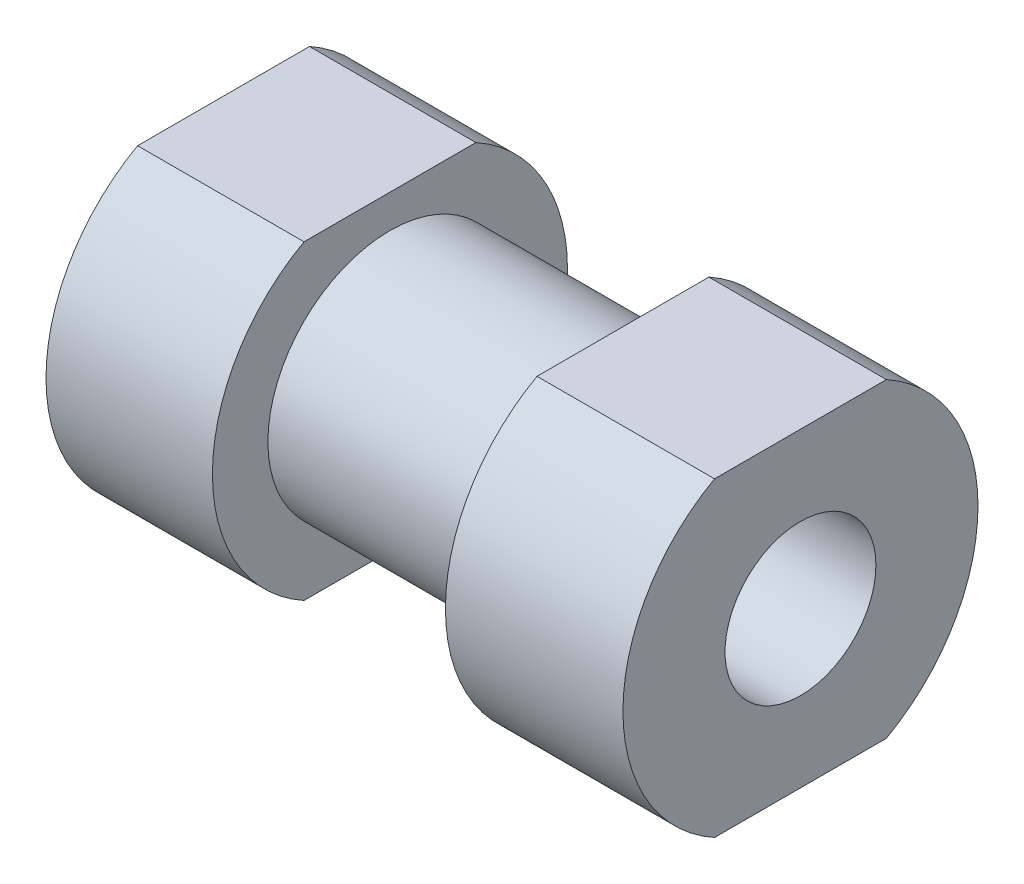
ISO-10303-21;
HEADER;
FILE_DESCRIPTION(('STEP AP214'),'2;1');
FILE_NAME('part.step','',(''),(''),'','','');
FILE_SCHEMA(('AUTOMOTIVE_DESIGN { 1 0 10303 214 1 1 1 1 }'));
ENDSEC;
DATA;
#1=APPLICATION_CONTEXT('core data for automotive mechanical design processes');
#2=APPLICATION_PROTOCOL_DEFINITION('international standard','automotive_design',2000,#1);
#3=PRODUCT_CONTEXT('',#1,'mechanical');
#4=PRODUCT('Part','Part','',(#3));
#5=PRODUCT_RELATED_PRODUCT_CATEGORY('part','',(#4));
#6=PRODUCT_DEFINITION_FORMATION('','',#4);
#7=PRODUCT_DEFINITION_CONTEXT('part definition',#1,'design');
#8=PRODUCT_DEFINITION('design','',#6,#7);
#9=PRODUCT_DEFINITION_SHAPE('','',#8);
#10=(LENGTH_UNIT() NAMED_UNIT(*) SI_UNIT(.MILLI.,.METRE.));
#11=(NAMED_UNIT(*) PLANE_ANGLE_UNIT() SI_UNIT($,.RADIAN.));
#12=(NAMED_UNIT(*) SI_UNIT($,.STERADIAN.) SOLID_ANGLE_UNIT());
#13=UNCERTAINTY_MEASURE_WITH_UNIT(LENGTH_MEASURE(1.E-05),#10,'distance_accuracy_value','');
#14=(GEOMETRIC_REPRESENTATION_CONTEXT(3) GLOBAL_UNCERTAINTY_ASSIGNED_CONTEXT((#13)) GLOBAL_UNIT_ASSIGNED_CONTEXT((#10,
#11,#12)) REPRESENTATION_CONTEXT('',''));
#15=CARTESIAN_POINT('',(0.,0.,0.));
#16=DIRECTION('',(0.,0.,1.));
#17=DIRECTION('',(1.,0.,0.));
#18=AXIS2_PLACEMENT_3D('',#15,#16,#17);
#19=CARTESIAN_POINT('',(97.4858594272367,330.502190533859,0.));
#20=DIRECTION('',(1.,0.,0.));
#21=DIRECTION('',(0.,0.,-1.));
#22=AXIS2_PLACEMENT_3D('',#19,#20,#21);
#23=CYLINDRICAL_SURFACE('',#22,8.);
#24=DIRECTION('',(1.,0.,0.));
#25=VECTOR('',#24,1.);
#26=CARTESIAN_POINT('',(97.4858594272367,337.502190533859,-3.87298334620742));
#27=LINE('',#26,#25);
#28=CARTESIAN_POINT('',(78.9858594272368,337.502190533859,-3.87298334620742));
#29=VERTEX_POINT('',#28);
#30=CARTESIAN_POINT('',(71.4858594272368,337.502190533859,-3.87298334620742));
#31=VERTEX_POINT('',#30);
#32=EDGE_CURVE('E192',#29,#31,#27,.F.);
#33=ORIENTED_EDGE('',*,*,#32,.F.);
#34=CARTESIAN_POINT('',(78.9858594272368,330.502190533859,0.));
#35=DIRECTION('',(1.,0.,0.));
#36=DIRECTION('',(0.,0.,-1.));
#37=AXIS2_PLACEMENT_3D('',#34,#35,#36);
#38=CIRCLE('',#37,8.);
#39=CARTESIAN_POINT('',(78.9858594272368,323.502190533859,-3.87298334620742));
#40=VERTEX_POINT('',#39);
#41=EDGE_CURVE('E117',#40,#29,#38,.T.);
#42=ORIENTED_EDGE('',*,*,#41,.F.);
#43=DIRECTION('',(1.,0.,0.));
#44=VECTOR('',#43,1.);
#45=CARTESIAN_POINT('',(97.4858594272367,323.502190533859,-3.87298334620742));
#46=LINE('',#45,#44);
#47=CARTESIAN_POINT('',(71.4858594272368,323.502190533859,-3.87298334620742));
#48=VERTEX_POINT('',#47);
#49=EDGE_CURVE('E137',#48,#40,#46,.T.);
#50=ORIENTED_EDGE('',*,*,#49,.F.);
#51=CARTESIAN_POINT('',(71.4858594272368,330.502190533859,0.));
#52=DIRECTION('',(1.,0.,0.));
#53=DIRECTION('',(0.,0.,-1.));
#54=AXIS2_PLACEMENT_3D('',#51,#52,#53);
#55=CIRCLE('',#54,8.);
#56=EDGE_CURVE('E121',#48,#31,#55,.T.);
#57=ORIENTED_EDGE('',*,*,#56,.T.);
#58=EDGE_LOOP('',(#33,#42,#50,#57));
#59=FACE_BOUND('',#58,.T.);
#60=ADVANCED_FACE('F16',(#59),#23,.T.);
#61=CARTESIAN_POINT('',(97.4858594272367,330.502190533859,0.));
#62=DIRECTION('',(1.,0.,0.));
#63=DIRECTION('',(0.,0.,-1.));
#64=AXIS2_PLACEMENT_3D('',#61,#62,#63);
#65=CYLINDRICAL_SURFACE('',#64,8.);
#66=DIRECTION('',(1.,0.,0.));
#67=VECTOR('',#66,1.);
#68=CARTESIAN_POINT('',(97.4858594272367,337.502190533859,-3.87298334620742));
#69=LINE('',#68,#67);
#70=CARTESIAN_POINT('',(97.4858594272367,337.502190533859,-3.87298334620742));
#71=VERTEX_POINT('',#70);
#72=CARTESIAN_POINT('',(89.4858594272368,337.502190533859,-3.87298334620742));
#73=VERTEX_POINT('',#72);
#74=EDGE_CURVE('E82',#71,#73,#69,.F.);
#75=ORIENTED_EDGE('',*,*,#74,.F.);
#76=CARTESIAN_POINT('',(97.4858594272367,330.502190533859,0.));
#77=DIRECTION('',(1.,0.,0.));
#78=DIRECTION('',(0.,0.,-1.));
#79=AXIS2_PLACEMENT_3D('',#76,#77,#78);
#80=CIRCLE('',#79,8.);
#81=CARTESIAN_POINT('',(97.4858594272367,323.502190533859,-3.87298334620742));
#82=VERTEX_POINT('',#81);
#83=EDGE_CURVE('E92',#82,#71,#80,.T.);
#84=ORIENTED_EDGE('',*,*,#83,.F.);
#85=DIRECTION('',(1.,0.,0.));
#86=VECTOR('',#85,1.);
#87=CARTESIAN_POINT('',(97.4858594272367,323.502190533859,-3.87298334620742));
#88=LINE('',#87,#86);
#89=CARTESIAN_POINT('',(89.4858594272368,323.502190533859,-3.87298334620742));
#90=VERTEX_POINT('',#89);
#91=EDGE_CURVE('E129',#90,#82,#88,.T.);
#92=ORIENTED_EDGE('',*,*,#91,.F.);
#93=CARTESIAN_POINT('',(89.4858594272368,330.502190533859,0.));
#94=DIRECTION('',(1.,0.,0.));
#95=DIRECTION('',(0.,0.,-1.));
#96=AXIS2_PLACEMENT_3D('',#93,#94,#95);
#97=CIRCLE('',#96,8.);
#98=EDGE_CURVE('E94',#90,#73,#97,.T.);
#99=ORIENTED_EDGE('',*,*,#98,.T.);
#100=EDGE_LOOP('',(#75,#84,#92,#99));
#101=FACE_BOUND('',#100,.T.);
#102=ADVANCED_FACE('F90',(#101),#65,.T.);
#103=CARTESIAN_POINT('',(71.4858594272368,330.502190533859,0.));
#104=DIRECTION('',(-1.,0.,0.));
#105=DIRECTION('',(0.,0.,1.));
#106=AXIS2_PLACEMENT_3D('',#103,#104,#105);
#107=PLANE('',#106);
#108=DIRECTION('',(0.,0.,-1.));
#109=VECTOR('',#108,1.);
#110=CARTESIAN_POINT('',(71.4858594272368,337.502190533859,-7.34638575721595));
#111=LINE('',#110,#109);
#112=CARTESIAN_POINT('',(71.4858594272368,337.502190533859,3.87298334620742));
#113=VERTEX_POINT('',#112);
#114=EDGE_CURVE('E197',#113,#31,#111,.T.);
#115=ORIENTED_EDGE('',*,*,#114,.T.);
#116=ORIENTED_EDGE('',*,*,#56,.F.);
#117=DIRECTION('',(0.,0.,1.));
#118=VECTOR('',#117,1.);
#119=CARTESIAN_POINT('',(71.4858594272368,323.502190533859,-7.34638575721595));
#120=LINE('',#119,#118);
#121=CARTESIAN_POINT('',(71.4858594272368,323.502190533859,3.87298334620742));
#122=VERTEX_POINT('',#121);
#123=EDGE_CURVE('E198',#48,#122,#120,.T.);
#124=ORIENTED_EDGE('',*,*,#123,.T.);
#125=EDGE_CURVE('E120',#113,#122,#55,.T.);
#126=ORIENTED_EDGE('',*,*,#125,.F.);
#127=EDGE_LOOP('',(#115,#116,#124,#126));
#128=FACE_BOUND('',#127,.T.);
#129=ADVANCED_FACE('F18',(#128),#107,.T.);
#130=DIRECTION('',(1.,0.,0.));
#131=VECTOR('',#130,1.);
#132=CARTESIAN_POINT('',(97.4858594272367,337.502190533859,3.87298334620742));
#133=LINE('',#132,#131);
#134=CARTESIAN_POINT('',(78.9858594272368,337.502190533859,3.87298334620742));
#135=VERTEX_POINT('',#134);
#136=EDGE_CURVE('E31',#113,#135,#133,.T.);
#137=ORIENTED_EDGE('',*,*,#136,.F.);
#138=ORIENTED_EDGE('',*,*,#125,.T.);
#139=DIRECTION('',(1.,0.,0.));
#140=VECTOR('',#139,1.);
#141=CARTESIAN_POINT('',(97.4858594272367,323.502190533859,3.87298334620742));
#142=LINE('',#141,#140);
#143=CARTESIAN_POINT('',(78.9858594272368,323.502190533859,3.87298334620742));
#144=VERTEX_POINT('',#143);
#145=EDGE_CURVE('E143',#144,#122,#142,.F.);
#146=ORIENTED_EDGE('',*,*,#145,.F.);
#147=EDGE_CURVE('E116',#135,#144,#38,.T.);
#148=ORIENTED_EDGE('',*,*,#147,.F.);
#149=EDGE_LOOP('',(#137,#138,#146,#148));
#150=FACE_BOUND('',#149,.T.);
#151=ADVANCED_FACE('F169',(#150),#23,.T.);
#152=CARTESIAN_POINT('',(78.9858594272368,338.502190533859,0.));
#153=DIRECTION('',(1.,0.,0.));
#154=DIRECTION('',(0.,0.,-1.));
#155=AXIS2_PLACEMENT_3D('',#152,#153,#154);
#156=PLANE('',#155);
#157=DIRECTION('',(0.,0.,-1.));
#158=VECTOR('',#157,1.);
#159=CARTESIAN_POINT('',(78.9858594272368,337.502190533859,0.));
#160=LINE('',#159,#158);
#161=EDGE_CURVE('E95',#135,#29,#160,.T.);
#162=ORIENTED_EDGE('',*,*,#161,.F.);
#163=ORIENTED_EDGE('',*,*,#147,.T.);
#164=DIRECTION('',(0.,0.,1.));
#165=VECTOR('',#164,1.);
#166=CARTESIAN_POINT('',(78.9858594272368,323.502190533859,0.));
#167=LINE('',#166,#165);
#168=EDGE_CURVE('E133',#40,#144,#167,.T.);
#169=ORIENTED_EDGE('',*,*,#168,.F.);
#170=ORIENTED_EDGE('',*,*,#41,.T.);
#171=EDGE_LOOP('',(#162,#163,#169,#170));
#172=FACE_BOUND('',#171,.T.);
#173=CARTESIAN_POINT('',(78.9858594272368,330.502190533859,0.));
#174=DIRECTION('',(1.,0.,0.));
#175=DIRECTION('',(0.,0.,-1.));
#176=AXIS2_PLACEMENT_3D('',#173,#174,#175);
#177=CIRCLE('',#176,5.5);
#178=CARTESIAN_POINT('',(78.9858594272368,330.502190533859,-5.5));
#179=VERTEX_POINT('',#178);
#180=EDGE_CURVE('E113',#179,#179,#177,.T.);
#181=ORIENTED_EDGE('',*,*,#180,.F.);
#182=EDGE_LOOP('',(#181));
#183=FACE_BOUND('',#182,.T.);
#184=ADVANCED_FACE('F179',(#172,#183),#156,.T.);
#185=CARTESIAN_POINT('',(97.4858594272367,330.502190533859,0.));
#186=DIRECTION('',(1.,0.,0.));
#187=DIRECTION('',(0.,0.,-1.));
#188=AXIS2_PLACEMENT_3D('',#185,#186,#187);
#189=CYLINDRICAL_SURFACE('',#188,5.5);
#190=ORIENTED_EDGE('',*,*,#180,.T.);
#191=EDGE_LOOP('',(#190));
#192=FACE_BOUND('',#191,.T.);
#193=CARTESIAN_POINT('',(89.4858594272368,330.502190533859,0.));
#194=DIRECTION('',(1.,0.,0.));
#195=DIRECTION('',(0.,0.,-1.));
#196=AXIS2_PLACEMENT_3D('',#193,#194,#195);
#197=CIRCLE('',#196,5.5);
#198=CARTESIAN_POINT('',(89.4858594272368,330.502190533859,-5.5));
#199=VERTEX_POINT('',#198);
#200=EDGE_CURVE('E110',#199,#199,#197,.T.);
#201=ORIENTED_EDGE('',*,*,#200,.F.);
#202=EDGE_LOOP('',(#201));
#203=FACE_BOUND('',#202,.T.);
#204=ADVANCED_FACE('F186',(#192,#203),#189,.T.);
#205=CARTESIAN_POINT('',(89.4858594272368,336.002190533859,0.));
#206=DIRECTION('',(-1.,0.,0.));
#207=DIRECTION('',(0.,0.,1.));
#208=AXIS2_PLACEMENT_3D('',#205,#206,#207);
#209=PLANE('',#208);
#210=DIRECTION('',(0.,0.,1.));
#211=VECTOR('',#210,1.);
#212=CARTESIAN_POINT('',(89.4858594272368,337.502190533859,0.));
#213=LINE('',#212,#211);
#214=CARTESIAN_POINT('',(89.4858594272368,337.502190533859,3.87298334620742));
#215=VERTEX_POINT('',#214);
#216=EDGE_CURVE('E96',#73,#215,#213,.T.);
#217=ORIENTED_EDGE('',*,*,#216,.F.);
#218=ORIENTED_EDGE('',*,*,#98,.F.);
#219=DIRECTION('',(0.,0.,-1.));
#220=VECTOR('',#219,1.);
#221=CARTESIAN_POINT('',(89.4858594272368,323.502190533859,0.));
#222=LINE('',#221,#220);
#223=CARTESIAN_POINT('',(89.4858594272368,323.502190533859,3.87298334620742));
#224=VERTEX_POINT('',#223);
#225=EDGE_CURVE('E134',#224,#90,#222,.T.);
#226=ORIENTED_EDGE('',*,*,#225,.F.);
#227=EDGE_CURVE('E102',#215,#224,#97,.T.);
#228=ORIENTED_EDGE('',*,*,#227,.F.);
#229=EDGE_LOOP('',(#217,#218,#226,#228));
#230=FACE_BOUND('',#229,.T.);
#231=ORIENTED_EDGE('',*,*,#200,.T.);
#232=EDGE_LOOP('',(#231));
#233=FACE_BOUND('',#232,.T.);
#234=ADVANCED_FACE('F208',(#230,#233),#209,.T.);
#235=DIRECTION('',(1.,0.,0.));
#236=VECTOR('',#235,1.);
#237=CARTESIAN_POINT('',(97.4858594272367,337.502190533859,3.87298334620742));
#238=LINE('',#237,#236);
#239=CARTESIAN_POINT('',(97.4858594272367,337.502190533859,3.87298334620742));
#240=VERTEX_POINT('',#239);
#241=EDGE_CURVE('E38',#215,#240,#238,.T.);
#242=ORIENTED_EDGE('',*,*,#241,.F.);
#243=ORIENTED_EDGE('',*,*,#227,.T.);
#244=DIRECTION('',(1.,0.,0.));
#245=VECTOR('',#244,1.);
#246=CARTESIAN_POINT('',(97.4858594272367,323.502190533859,3.87298334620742));
#247=LINE('',#246,#245);
#248=CARTESIAN_POINT('',(97.4858594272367,323.502190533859,3.87298334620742));
#249=VERTEX_POINT('',#248);
#250=EDGE_CURVE('E127',#249,#224,#247,.F.);
#251=ORIENTED_EDGE('',*,*,#250,.F.);
#252=EDGE_CURVE('E103',#240,#249,#80,.T.);
#253=ORIENTED_EDGE('',*,*,#252,.F.);
#254=EDGE_LOOP('',(#242,#243,#251,#253));
#255=FACE_BOUND('',#254,.T.);
#256=ADVANCED_FACE('F131',(#255),#65,.T.);
#257=CARTESIAN_POINT('',(97.4858594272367,338.502190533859,0.));
#258=DIRECTION('',(1.,0.,0.));
#259=DIRECTION('',(0.,0.,-1.));
#260=AXIS2_PLACEMENT_3D('',#257,#258,#259);
#261=PLANE('',#260);
#262=DIRECTION('',(0.,0.,-1.));
#263=VECTOR('',#262,1.);
#264=CARTESIAN_POINT('',(97.4858594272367,337.502190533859,0.));
#265=LINE('',#264,#263);
#266=EDGE_CURVE('E11',#240,#71,#265,.T.);
#267=ORIENTED_EDGE('',*,*,#266,.F.);
#268=ORIENTED_EDGE('',*,*,#252,.T.);
#269=DIRECTION('',(0.,0.,1.));
#270=VECTOR('',#269,1.);
#271=CARTESIAN_POINT('',(97.4858594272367,323.502190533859,0.));
#272=LINE('',#271,#270);
#273=EDGE_CURVE('E24',#82,#249,#272,.T.);
#274=ORIENTED_EDGE('',*,*,#273,.F.);
#275=ORIENTED_EDGE('',*,*,#83,.T.);
#276=EDGE_LOOP('',(#267,#268,#274,#275));
#277=FACE_BOUND('',#276,.T.);
#278=CARTESIAN_POINT('',(97.4858594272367,330.502190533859,0.));
#279=DIRECTION('',(1.,0.,0.));
#280=DIRECTION('',(0.,0.,-1.));
#281=AXIS2_PLACEMENT_3D('',#278,#279,#280);
#282=CIRCLE('',#281,3.4);
#283=CARTESIAN_POINT('',(97.4858594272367,330.502190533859,-3.4));
#284=VERTEX_POINT('',#283);
#285=EDGE_CURVE('E145',#284,#284,#282,.T.);
#286=ORIENTED_EDGE('',*,*,#285,.F.);
#287=EDGE_LOOP('',(#286));
#288=FACE_BOUND('',#287,.T.);
#289=ADVANCED_FACE('F99',(#277,#288),#261,.T.);
#290=CARTESIAN_POINT('',(77.7358594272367,330.502190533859,0.));
#291=DIRECTION('',(1.,0.,0.));
#292=DIRECTION('',(0.,0.,-1.));
#293=AXIS2_PLACEMENT_3D('',#290,#291,#292);
#294=CONICAL_SURFACE('',#293,3.4,1.02974425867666);
#295=CARTESIAN_POINT('',(75.692933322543,330.502190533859,0.));
#296=VERTEX_POINT('',#295);
#297=VERTEX_LOOP('',#296);
#298=FACE_BOUND('',#297,.T.);
#299=CARTESIAN_POINT('',(77.7358594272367,330.502190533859,0.));
#300=DIRECTION('',(1.,0.,0.));
#301=DIRECTION('',(0.,0.,-1.));
#302=AXIS2_PLACEMENT_3D('',#299,#300,#301);
#303=CIRCLE('',#302,3.4);
#304=CARTESIAN_POINT('',(77.7358594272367,330.502190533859,-3.4));
#305=VERTEX_POINT('',#304);
#306=EDGE_CURVE('E106',#305,#305,#303,.T.);
#307=ORIENTED_EDGE('',*,*,#306,.T.);
#308=EDGE_LOOP('',(#307));
#309=FACE_BOUND('',#308,.T.);
#310=ADVANCED_FACE('F152',(#298,#309),#294,.F.);
#311=CARTESIAN_POINT('',(97.4858594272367,330.502190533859,0.));
#312=DIRECTION('',(1.,0.,0.));
#313=DIRECTION('',(0.,0.,-1.));
#314=AXIS2_PLACEMENT_3D('',#311,#312,#313);
#315=CYLINDRICAL_SURFACE('',#314,3.4);
#316=ORIENTED_EDGE('',*,*,#306,.F.);
#317=EDGE_LOOP('',(#316));
#318=FACE_BOUND('',#317,.T.);
#319=ORIENTED_EDGE('',*,*,#285,.T.);
#320=EDGE_LOOP('',(#319));
#321=FACE_BOUND('',#320,.T.);
#322=ADVANCED_FACE('F154',(#318,#321),#315,.F.);
#323=CARTESIAN_POINT('',(71.4858594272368,323.502190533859,-7.34638575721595));
#324=DIRECTION('',(0.,1.,0.));
#325=DIRECTION('',(0.,0.,1.));
#326=AXIS2_PLACEMENT_3D('',#323,#324,#325);
#327=PLANE('',#326);
#328=ORIENTED_EDGE('',*,*,#250,.T.);
#329=ORIENTED_EDGE('',*,*,#225,.T.);
#330=ORIENTED_EDGE('',*,*,#91,.T.);
#331=ORIENTED_EDGE('',*,*,#273,.T.);
#332=EDGE_LOOP('',(#328,#329,#330,#331));
#333=FACE_BOUND('',#332,.T.);
#334=ADVANCED_FACE('F126',(#333),#327,.F.);
#335=ORIENTED_EDGE('',*,*,#145,.T.);
#336=ORIENTED_EDGE('',*,*,#123,.F.);
#337=ORIENTED_EDGE('',*,*,#49,.T.);
#338=ORIENTED_EDGE('',*,*,#168,.T.);
#339=EDGE_LOOP('',(#335,#336,#337,#338));
#340=FACE_BOUND('',#339,.T.);
#341=ADVANCED_FACE('F162',(#340),#327,.F.);
#342=CARTESIAN_POINT('',(71.4858594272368,337.502190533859,-7.34638575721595));
#343=DIRECTION('',(0.,-1.,0.));
#344=DIRECTION('',(0.,0.,-1.));
#345=AXIS2_PLACEMENT_3D('',#342,#343,#344);
#346=PLANE('',#345);
#347=ORIENTED_EDGE('',*,*,#74,.T.);
#348=ORIENTED_EDGE('',*,*,#216,.T.);
#349=ORIENTED_EDGE('',*,*,#241,.T.);
#350=ORIENTED_EDGE('',*,*,#266,.T.);
#351=EDGE_LOOP('',(#347,#348,#349,#350));
#352=FACE_BOUND('',#351,.T.);
#353=ADVANCED_FACE('F81',(#352),#346,.F.);
#354=ORIENTED_EDGE('',*,*,#32,.T.);
#355=ORIENTED_EDGE('',*,*,#114,.F.);
#356=ORIENTED_EDGE('',*,*,#136,.T.);
#357=ORIENTED_EDGE('',*,*,#161,.T.);
#358=EDGE_LOOP('',(#354,#355,#356,#357));
#359=FACE_BOUND('',#358,.T.);
#360=ADVANCED_FACE('F260',(#359),#346,.F.);
#361=CLOSED_SHELL('',(#60,#102,#129,#151,#184,#204,#234,#256,#289,#310,#322,#334,#341,#353,#360));
#362=MANIFOLD_SOLID_BREP('B1',#361);
#363=ADVANCED_BREP_SHAPE_REPRESENTATION('',(#18,#362),#14);
#364=SHAPE_DEFINITION_REPRESENTATION(#9,#363);
ENDSEC;
END-ISO-10303-21;
